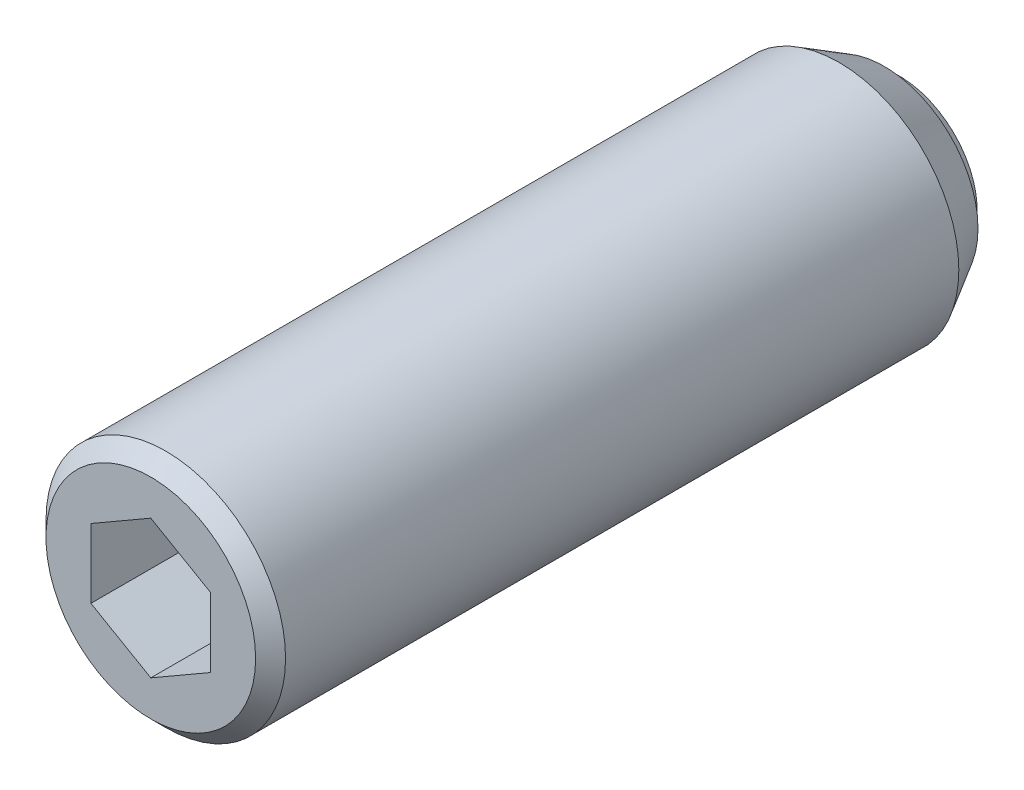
ISO-10303-21;
HEADER;
FILE_DESCRIPTION(('STEP AP214'),'2;1');
FILE_NAME('part.step','',(''),(''),'','','');
FILE_SCHEMA(('AUTOMOTIVE_DESIGN { 1 0 10303 214 1 1 1 1 }'));
ENDSEC;
DATA;
#1=APPLICATION_CONTEXT('core data for automotive mechanical design processes');
#2=APPLICATION_PROTOCOL_DEFINITION('international standard','automotive_design',2000,#1);
#3=PRODUCT_CONTEXT('',#1,'mechanical');
#4=PRODUCT('Part','Part','',(#3));
#5=PRODUCT_RELATED_PRODUCT_CATEGORY('part','',(#4));
#6=PRODUCT_DEFINITION_FORMATION('','',#4);
#7=PRODUCT_DEFINITION_CONTEXT('part definition',#1,'design');
#8=PRODUCT_DEFINITION('design','',#6,#7);
#9=PRODUCT_DEFINITION_SHAPE('','',#8);
#10=(LENGTH_UNIT() NAMED_UNIT(*) SI_UNIT(.MILLI.,.METRE.));
#11=(NAMED_UNIT(*) PLANE_ANGLE_UNIT() SI_UNIT($,.RADIAN.));
#12=(NAMED_UNIT(*) SI_UNIT($,.STERADIAN.) SOLID_ANGLE_UNIT());
#13=UNCERTAINTY_MEASURE_WITH_UNIT(LENGTH_MEASURE(1.E-05),#10,'distance_accuracy_value','');
#14=(GEOMETRIC_REPRESENTATION_CONTEXT(3) GLOBAL_UNCERTAINTY_ASSIGNED_CONTEXT((#13)) GLOBAL_UNIT_ASSIGNED_CONTEXT((#10,
#11,#12)) REPRESENTATION_CONTEXT('',''));
#15=CARTESIAN_POINT('',(0.,0.,0.));
#16=DIRECTION('',(0.,0.,1.));
#17=DIRECTION('',(1.,0.,0.));
#18=AXIS2_PLACEMENT_3D('',#15,#16,#17);
#19=CARTESIAN_POINT('',(4.,2.30940107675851,47.5));
#20=DIRECTION('',(0.5,0.86602540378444,0.));
#21=DIRECTION('',(0.86602540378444,-0.5,0.));
#22=AXIS2_PLACEMENT_3D('',#19,#20,#21);
#23=PLANE('',#22);
#24=DIRECTION('',(0.,0.,1.));
#25=VECTOR('',#24,1.);
#26=CARTESIAN_POINT('',(4.,2.30940107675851,47.5));
#27=LINE('',#26,#25);
#28=CARTESIAN_POINT('',(4.,2.30940107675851,44.));
#29=VERTEX_POINT('',#28);
#30=CARTESIAN_POINT('',(4.,2.30940107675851,50.));
#31=VERTEX_POINT('',#30);
#32=EDGE_CURVE('E68',#29,#31,#27,.T.);
#33=ORIENTED_EDGE('',*,*,#32,.T.);
#34=DIRECTION('',(-0.86602540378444,0.5,0.));
#35=VECTOR('',#34,1.);
#36=CARTESIAN_POINT('',(4.,2.30940107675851,50.));
#37=LINE('',#36,#35);
#38=CARTESIAN_POINT('',(0.,4.618802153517,50.));
#39=VERTEX_POINT('',#38);
#40=EDGE_CURVE('E29',#31,#39,#37,.T.);
#41=ORIENTED_EDGE('',*,*,#40,.T.);
#42=DIRECTION('',(0.,0.,1.));
#43=VECTOR('',#42,1.);
#44=CARTESIAN_POINT('',(0.,4.618802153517,47.5));
#45=LINE('',#44,#43);
#46=CARTESIAN_POINT('',(0.,4.618802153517,44.));
#47=VERTEX_POINT('',#46);
#48=EDGE_CURVE('E80',#47,#39,#45,.T.);
#49=ORIENTED_EDGE('',*,*,#48,.F.);
#50=DIRECTION('',(-0.86602540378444,0.5,0.));
#51=VECTOR('',#50,1.);
#52=CARTESIAN_POINT('',(4.,2.30940107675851,44.));
#53=LINE('',#52,#51);
#54=EDGE_CURVE('E79',#29,#47,#53,.T.);
#55=ORIENTED_EDGE('',*,*,#54,.F.);
#56=EDGE_LOOP('',(#33,#41,#49,#55));
#57=FACE_BOUND('',#56,.T.);
#58=ADVANCED_FACE('F14',(#57),#23,.F.);
#59=CARTESIAN_POINT('',(4.,-2.30940107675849,47.5));
#60=DIRECTION('',(1.,0.,0.));
#61=DIRECTION('',(0.,-1.,0.));
#62=AXIS2_PLACEMENT_3D('',#59,#60,#61);
#63=PLANE('',#62);
#64=DIRECTION('',(0.,0.,1.));
#65=VECTOR('',#64,1.);
#66=CARTESIAN_POINT('',(4.,-2.30940107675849,47.5));
#67=LINE('',#66,#65);
#68=CARTESIAN_POINT('',(4.,-2.30940107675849,44.));
#69=VERTEX_POINT('',#68);
#70=CARTESIAN_POINT('',(4.,-2.30940107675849,50.));
#71=VERTEX_POINT('',#70);
#72=EDGE_CURVE('E76',#69,#71,#67,.T.);
#73=ORIENTED_EDGE('',*,*,#72,.T.);
#74=DIRECTION('',(0.,1.,0.));
#75=VECTOR('',#74,1.);
#76=CARTESIAN_POINT('',(4.,-2.30940107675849,50.));
#77=LINE('',#76,#75);
#78=EDGE_CURVE('E75',#71,#31,#77,.T.);
#79=ORIENTED_EDGE('',*,*,#78,.T.);
#80=ORIENTED_EDGE('',*,*,#32,.F.);
#81=DIRECTION('',(0.,1.,0.));
#82=VECTOR('',#81,1.);
#83=CARTESIAN_POINT('',(4.,-2.30940107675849,44.));
#84=LINE('',#83,#82);
#85=EDGE_CURVE('E72',#69,#29,#84,.T.);
#86=ORIENTED_EDGE('',*,*,#85,.F.);
#87=EDGE_LOOP('',(#73,#79,#80,#86));
#88=FACE_BOUND('',#87,.T.);
#89=ADVANCED_FACE('F70',(#88),#63,.F.);
#90=CARTESIAN_POINT('',(4.,-2.30940107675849,47.5));
#91=DIRECTION('',(-0.5,0.866025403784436,0.));
#92=DIRECTION('',(0.866025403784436,0.5,0.));
#93=AXIS2_PLACEMENT_3D('',#90,#91,#92);
#94=PLANE('',#93);
#95=DIRECTION('',(0.,0.,1.));
#96=VECTOR('',#95,1.);
#97=CARTESIAN_POINT('',(0.,-4.61880215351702,47.5));
#98=LINE('',#97,#96);
#99=CARTESIAN_POINT('',(0.,-4.61880215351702,44.));
#100=VERTEX_POINT('',#99);
#101=CARTESIAN_POINT('',(0.,-4.61880215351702,50.));
#102=VERTEX_POINT('',#101);
#103=EDGE_CURVE('E122',#100,#102,#98,.T.);
#104=ORIENTED_EDGE('',*,*,#103,.T.);
#105=DIRECTION('',(-0.866025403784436,-0.5,0.));
#106=VECTOR('',#105,1.);
#107=CARTESIAN_POINT('',(4.,-2.30940107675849,50.));
#108=LINE('',#107,#106);
#109=EDGE_CURVE('E113',#71,#102,#108,.T.);
#110=ORIENTED_EDGE('',*,*,#109,.F.);
#111=ORIENTED_EDGE('',*,*,#72,.F.);
#112=DIRECTION('',(0.866025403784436,0.5,0.));
#113=VECTOR('',#112,1.);
#114=CARTESIAN_POINT('',(0.,-4.61880215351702,44.));
#115=LINE('',#114,#113);
#116=EDGE_CURVE('E89',#100,#69,#115,.T.);
#117=ORIENTED_EDGE('',*,*,#116,.F.);
#118=EDGE_LOOP('',(#104,#110,#111,#117));
#119=FACE_BOUND('',#118,.T.);
#120=ADVANCED_FACE('F147',(#119),#94,.T.);
#121=CARTESIAN_POINT('',(-4.,-2.30940107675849,47.5));
#122=DIRECTION('',(-0.5,-0.866025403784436,0.));
#123=DIRECTION('',(-0.866025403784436,0.5,0.));
#124=AXIS2_PLACEMENT_3D('',#121,#122,#123);
#125=PLANE('',#124);
#126=DIRECTION('',(0.,0.,1.));
#127=VECTOR('',#126,1.);
#128=CARTESIAN_POINT('',(-4.,-2.30940107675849,47.5));
#129=LINE('',#128,#127);
#130=CARTESIAN_POINT('',(-4.,-2.30940107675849,44.));
#131=VERTEX_POINT('',#130);
#132=CARTESIAN_POINT('',(-4.,-2.30940107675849,50.));
#133=VERTEX_POINT('',#132);
#134=EDGE_CURVE('E120',#131,#133,#129,.T.);
#135=ORIENTED_EDGE('',*,*,#134,.T.);
#136=DIRECTION('',(0.866025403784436,-0.5,0.));
#137=VECTOR('',#136,1.);
#138=CARTESIAN_POINT('',(-4.,-2.30940107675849,50.));
#139=LINE('',#138,#137);
#140=EDGE_CURVE('E111',#133,#102,#139,.T.);
#141=ORIENTED_EDGE('',*,*,#140,.T.);
#142=ORIENTED_EDGE('',*,*,#103,.F.);
#143=DIRECTION('',(0.866025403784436,-0.5,0.));
#144=VECTOR('',#143,1.);
#145=CARTESIAN_POINT('',(-4.,-2.30940107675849,44.));
#146=LINE('',#145,#144);
#147=EDGE_CURVE('E101',#131,#100,#146,.T.);
#148=ORIENTED_EDGE('',*,*,#147,.F.);
#149=EDGE_LOOP('',(#135,#141,#142,#148));
#150=FACE_BOUND('',#149,.T.);
#151=ADVANCED_FACE('F157',(#150),#125,.F.);
#152=CARTESIAN_POINT('',(-4.,-2.30940107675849,47.5));
#153=DIRECTION('',(1.,0.,0.));
#154=DIRECTION('',(0.,-1.,0.));
#155=AXIS2_PLACEMENT_3D('',#152,#153,#154);
#156=PLANE('',#155);
#157=DIRECTION('',(0.,0.,1.));
#158=VECTOR('',#157,1.);
#159=CARTESIAN_POINT('',(-4.,2.30940107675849,47.5));
#160=LINE('',#159,#158);
#161=CARTESIAN_POINT('',(-4.,2.30940107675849,44.));
#162=VERTEX_POINT('',#161);
#163=CARTESIAN_POINT('',(-4.,2.30940107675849,50.));
#164=VERTEX_POINT('',#163);
#165=EDGE_CURVE('E37',#162,#164,#160,.T.);
#166=ORIENTED_EDGE('',*,*,#165,.T.);
#167=DIRECTION('',(0.,1.,0.));
#168=VECTOR('',#167,1.);
#169=CARTESIAN_POINT('',(-4.,-2.30940107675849,50.));
#170=LINE('',#169,#168);
#171=EDGE_CURVE('E108',#133,#164,#170,.T.);
#172=ORIENTED_EDGE('',*,*,#171,.F.);
#173=ORIENTED_EDGE('',*,*,#134,.F.);
#174=DIRECTION('',(0.,-1.,0.));
#175=VECTOR('',#174,1.);
#176=CARTESIAN_POINT('',(-4.,2.30940107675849,44.));
#177=LINE('',#176,#175);
#178=EDGE_CURVE('E98',#162,#131,#177,.T.);
#179=ORIENTED_EDGE('',*,*,#178,.F.);
#180=EDGE_LOOP('',(#166,#172,#173,#179));
#181=FACE_BOUND('',#180,.T.);
#182=ADVANCED_FACE('F153',(#181),#156,.T.);
#183=CARTESIAN_POINT('',(-4.,2.30940107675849,47.5));
#184=DIRECTION('',(0.5,-0.866025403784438,0.));
#185=DIRECTION('',(-0.866025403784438,-0.5,0.));
#186=AXIS2_PLACEMENT_3D('',#183,#184,#185);
#187=PLANE('',#186);
#188=ORIENTED_EDGE('',*,*,#165,.F.);
#189=DIRECTION('',(-0.866025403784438,-0.5,0.));
#190=VECTOR('',#189,1.);
#191=CARTESIAN_POINT('',(0.,4.618802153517,44.));
#192=LINE('',#191,#190);
#193=EDGE_CURVE('E84',#47,#162,#192,.T.);
#194=ORIENTED_EDGE('',*,*,#193,.F.);
#195=ORIENTED_EDGE('',*,*,#48,.T.);
#196=DIRECTION('',(0.866025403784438,0.5,0.));
#197=VECTOR('',#196,1.);
#198=CARTESIAN_POINT('',(-4.,2.30940107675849,50.));
#199=LINE('',#198,#197);
#200=EDGE_CURVE('E105',#164,#39,#199,.T.);
#201=ORIENTED_EDGE('',*,*,#200,.F.);
#202=EDGE_LOOP('',(#188,#194,#195,#201));
#203=FACE_BOUND('',#202,.T.);
#204=ADVANCED_FACE('F150',(#203),#187,.T.);
#205=CARTESIAN_POINT('',(0.,0.,49.75));
#206=DIRECTION('',(0.,0.,-1.));
#207=DIRECTION('',(1.,0.,0.));
#208=AXIS2_PLACEMENT_3D('',#205,#206,#207);
#209=CYLINDRICAL_SURFACE('',#208,8.);
#210=CARTESIAN_POINT('',(0.,0.,49.));
#211=DIRECTION('',(0.,0.,-1.));
#212=DIRECTION('',(1.,0.,0.));
#213=AXIS2_PLACEMENT_3D('',#210,#211,#212);
#214=CIRCLE('',#213,8.);
#215=CARTESIAN_POINT('',(8.,0.,49.));
#216=VERTEX_POINT('',#215);
#217=EDGE_CURVE('E9',#216,#216,#214,.T.);
#218=ORIENTED_EDGE('',*,*,#217,.T.);
#219=EDGE_LOOP('',(#218));
#220=FACE_BOUND('',#219,.T.);
#221=CARTESIAN_POINT('',(0.,0.,4.03108891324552));
#222=DIRECTION('',(0.,0.,-1.));
#223=DIRECTION('',(-1.,0.,0.));
#224=AXIS2_PLACEMENT_3D('',#221,#222,#223);
#225=CIRCLE('',#224,8.);
#226=CARTESIAN_POINT('',(-8.,0.,4.03108891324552));
#227=VERTEX_POINT('',#226);
#228=EDGE_CURVE('E260',#227,#227,#225,.T.);
#229=ORIENTED_EDGE('',*,*,#228,.F.);
#230=EDGE_LOOP('',(#229));
#231=FACE_BOUND('',#230,.T.);
#232=ADVANCED_FACE('F16',(#220,#231),#209,.T.);
#233=CARTESIAN_POINT('',(0.,0.,49.));
#234=DIRECTION('',(0.,0.,-1.));
#235=DIRECTION('',(1.,0.,0.));
#236=AXIS2_PLACEMENT_3D('',#233,#234,#235);
#237=CONICAL_SURFACE('',#236,8.,0.785398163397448);
#238=CARTESIAN_POINT('',(0.,0.,50.));
#239=DIRECTION('',(0.,0.,-1.));
#240=DIRECTION('',(1.,0.,0.));
#241=AXIS2_PLACEMENT_3D('',#238,#239,#240);
#242=CIRCLE('',#241,7.);
#243=CARTESIAN_POINT('',(7.,0.,50.));
#244=VERTEX_POINT('',#243);
#245=EDGE_CURVE('E22',#244,#244,#242,.T.);
#246=ORIENTED_EDGE('',*,*,#245,.T.);
#247=EDGE_LOOP('',(#246));
#248=FACE_BOUND('',#247,.T.);
#249=ORIENTED_EDGE('',*,*,#217,.F.);
#250=EDGE_LOOP('',(#249));
#251=FACE_BOUND('',#250,.T.);
#252=ADVANCED_FACE('F127',(#248,#251),#237,.T.);
#253=CARTESIAN_POINT('',(0.,0.,50.));
#254=DIRECTION('',(0.,0.,-1.));
#255=DIRECTION('',(1.,0.,0.));
#256=AXIS2_PLACEMENT_3D('',#253,#254,#255);
#257=PLANE('',#256);
#258=ORIENTED_EDGE('',*,*,#200,.T.);
#259=ORIENTED_EDGE('',*,*,#40,.F.);
#260=ORIENTED_EDGE('',*,*,#78,.F.);
#261=ORIENTED_EDGE('',*,*,#109,.T.);
#262=ORIENTED_EDGE('',*,*,#140,.F.);
#263=ORIENTED_EDGE('',*,*,#171,.T.);
#264=EDGE_LOOP('',(#258,#259,#260,#261,#262,#263));
#265=FACE_BOUND('',#264,.T.);
#266=ORIENTED_EDGE('',*,*,#245,.F.);
#267=EDGE_LOOP('',(#266));
#268=FACE_BOUND('',#267,.T.);
#269=ADVANCED_FACE('F130',(#265,#268),#257,.F.);
#270=CARTESIAN_POINT('',(4.,2.30940107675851,44.));
#271=DIRECTION('',(0.,0.,1.));
#272=DIRECTION('',(1.,0.,0.));
#273=AXIS2_PLACEMENT_3D('',#270,#271,#272);
#274=PLANE('',#273);
#275=ORIENTED_EDGE('',*,*,#85,.T.);
#276=ORIENTED_EDGE('',*,*,#54,.T.);
#277=ORIENTED_EDGE('',*,*,#193,.T.);
#278=ORIENTED_EDGE('',*,*,#178,.T.);
#279=ORIENTED_EDGE('',*,*,#147,.T.);
#280=ORIENTED_EDGE('',*,*,#116,.T.);
#281=EDGE_LOOP('',(#275,#276,#277,#278,#279,#280));
#282=FACE_BOUND('',#281,.T.);
#283=ADVANCED_FACE('F86',(#282),#274,.T.);
#284=CARTESIAN_POINT('',(0.,0.,0.));
#285=DIRECTION('',(0.,0.,-1.));
#286=DIRECTION('',(-1.,0.,0.));
#287=AXIS2_PLACEMENT_3D('',#284,#285,#286);
#288=PLANE('',#287);
#289=CARTESIAN_POINT('',(0.,0.,0.));
#290=DIRECTION('',(0.,0.,-1.));
#291=DIRECTION('',(-1.,0.,0.));
#292=AXIS2_PLACEMENT_3D('',#289,#290,#291);
#293=CIRCLE('',#292,5.19615242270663);
#294=CARTESIAN_POINT('',(-5.19615242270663,0.,0.));
#295=VERTEX_POINT('',#294);
#296=EDGE_CURVE('E90',#295,#295,#293,.T.);
#297=ORIENTED_EDGE('',*,*,#296,.T.);
#298=EDGE_LOOP('',(#297));
#299=FACE_BOUND('',#298,.T.);
#300=ADVANCED_FACE('F139',(#299),#288,.T.);
#301=CARTESIAN_POINT('',(0.,0.,3.));
#302=DIRECTION('',(0.,0.,-1.));
#303=DIRECTION('',(-1.,0.,0.));
#304=AXIS2_PLACEMENT_3D('',#301,#302,#303);
#305=SPHERICAL_SURFACE('',#304,6.);
#306=CARTESIAN_POINT('',(0.,0.,1.));
#307=DIRECTION('',(0.,0.,-1.));
#308=DIRECTION('',(-1.,0.,0.));
#309=AXIS2_PLACEMENT_3D('',#306,#307,#308);
#310=CIRCLE('',#309,5.65685424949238);
#311=CARTESIAN_POINT('',(-5.65685424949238,0.,1.));
#312=VERTEX_POINT('',#311);
#313=EDGE_CURVE('E93',#312,#312,#310,.T.);
#314=CARTESIAN_POINT('',(-5.65685424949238,0.,1.));
#315=CARTESIAN_POINT('',(-5.65302587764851,0.,0.989171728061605));
#316=CARTESIAN_POINT('',(-5.64916641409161,0.,0.978354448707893));
#317=CARTESIAN_POINT('',(-5.64138543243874,0.,0.956742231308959));
#318=CARTESIAN_POINT('',(-5.63746391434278,0.,0.945947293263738));
#319=CARTESIAN_POINT('',(-5.62955895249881,0.,0.924380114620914));
#320=CARTESIAN_POINT('',(-5.62557550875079,0.,0.913607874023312));
#321=CARTESIAN_POINT('',(-5.61754682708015,0.,0.892086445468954));
#322=CARTESIAN_POINT('',(-5.61350158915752,0.,0.881337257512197));
#323=CARTESIAN_POINT('',(-5.60534945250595,0.,0.859862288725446));
#324=CARTESIAN_POINT('',(-5.60124255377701,0.,0.849136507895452));
#325=CARTESIAN_POINT('',(-5.59296723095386,0.,0.827708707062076));
#326=CARTESIAN_POINT('',(-5.58879880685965,0.,0.817006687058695));
#327=CARTESIAN_POINT('',(-5.58040057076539,0.,0.795626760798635));
#328=CARTESIAN_POINT('',(-5.57617075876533,0.,0.784948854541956));
#329=CARTESIAN_POINT('',(-5.56764988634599,0.,0.763617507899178));
#330=CARTESIAN_POINT('',(-5.56335882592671,0.,0.752964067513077));
#331=CARTESIAN_POINT('',(-5.55471559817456,0.,0.731682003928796));
#332=CARTESIAN_POINT('',(-5.55036343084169,0.,0.721053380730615));
#333=CARTESIAN_POINT('',(-5.54159813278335,0.,0.699821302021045));
#334=CARTESIAN_POINT('',(-5.53718500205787,0.,0.689217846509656));
#335=CARTESIAN_POINT('',(-5.52829792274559,0.,0.668036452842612));
#336=CARTESIAN_POINT('',(-5.52382397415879,0.,0.657458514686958));
#337=CARTESIAN_POINT('',(-5.51481540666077,0.,0.636328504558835));
#338=CARTESIAN_POINT('',(-5.51028078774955,0.,0.625776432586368));
#339=CARTESIAN_POINT('',(-5.50115102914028,0.,0.604698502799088));
#340=CARTESIAN_POINT('',(-5.49655588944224,0.,0.594172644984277));
#341=CARTESIAN_POINT('',(-5.48730524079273,0.,0.573147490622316));
#342=CARTESIAN_POINT('',(-5.48264973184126,0.,0.562648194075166));
#343=CARTESIAN_POINT('',(-5.47327849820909,0.,0.541676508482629));
#344=CARTESIAN_POINT('',(-5.46856277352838,0.,0.531204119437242));
#345=CARTESIAN_POINT('',(-5.45907126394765,0.,0.510286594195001));
#346=CARTESIAN_POINT('',(-5.45429547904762,0.,0.499841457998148));
#347=CARTESIAN_POINT('',(-5.44468400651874,0.,0.478978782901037));
#348=CARTESIAN_POINT('',(-5.43984831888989,0.,0.468561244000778));
#349=CARTESIAN_POINT('',(-5.4301172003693,0.,0.447754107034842));
#350=CARTESIAN_POINT('',(-5.42522176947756,0.,0.437364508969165));
#351=CARTESIAN_POINT('',(-5.41537132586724,0.,0.416613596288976));
#352=CARTESIAN_POINT('',(-5.41041631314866,0.,0.406252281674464));
#353=CARTESIAN_POINT('',(-5.40044686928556,0.,0.38555827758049));
#354=CARTESIAN_POINT('',(-5.39543243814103,0.,0.375225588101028));
#355=CARTESIAN_POINT('',(-5.38534432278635,0.,0.354589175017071));
#356=CARTESIAN_POINT('',(-5.3802706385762,0.,0.344285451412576));
#357=CARTESIAN_POINT('',(-5.37006418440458,0.,0.323707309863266));
#358=CARTESIAN_POINT('',(-5.3649314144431,0.,0.313432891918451));
#359=CARTESIAN_POINT('',(-5.35460695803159,0.,0.292913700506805));
#360=CARTESIAN_POINT('',(-5.34941527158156,0.,0.282668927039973));
#361=CARTESIAN_POINT('',(-5.33897315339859,0.,0.262209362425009));
#362=CARTESIAN_POINT('',(-5.33372272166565,0.,0.251994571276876));
#363=CARTESIAN_POINT('',(-5.32316328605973,0.,0.231595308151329));
#364=CARTESIAN_POINT('',(-5.31785428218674,0.,0.221410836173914));
#365=CARTESIAN_POINT('',(-5.30717787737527,0.,0.201072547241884));
#366=CARTESIAN_POINT('',(-5.30181047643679,0.,0.190918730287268));
#367=CARTESIAN_POINT('',(-5.29101745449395,0.,0.170642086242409));
#368=CARTESIAN_POINT('',(-5.28559183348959,0.,0.160519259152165));
#369=CARTESIAN_POINT('',(-5.27468255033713,0.,0.140304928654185));
#370=CARTESIAN_POINT('',(-5.26919888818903,0.,0.130213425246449));
#371=CARTESIAN_POINT('',(-5.25817370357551,0.,0.110062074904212));
#372=CARTESIAN_POINT('',(-5.25263218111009,0.,0.100002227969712));
#373=CARTESIAN_POINT('',(-5.24149145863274,0.,0.0799145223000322));
#374=CARTESIAN_POINT('',(-5.23589225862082,0.,0.0698866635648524));
#375=CARTESIAN_POINT('',(-5.22463636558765,0.,0.0498632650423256));
#376=CARTESIAN_POINT('',(-5.2189796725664,0.,0.0398677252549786));
#377=CARTESIAN_POINT('',(-5.20760898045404,0.,0.0199092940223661));
#378=CARTESIAN_POINT('',(-5.20189498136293,0.,0.00994640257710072));
#379=CARTESIAN_POINT('',(-5.19615242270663,0.,0.));
#380=B_SPLINE_CURVE_WITH_KNOTS('',3,(#314,#315,#316,#317,#318,#319,#320,#321,#322,#323,#324,
#325,#326,#327,#328,#329,#330,#331,#332,#333,#334,#335,#336,#337,#338,#339,#340,#341,#342,#343,
#344,#345,#346,#347,#348,#349,#350,#351,#352,#353,#354,#355,#356,#357,#358,#359,#360,#361,#362,
#363,#364,#365,#366,#367,#368,#369,#370,#371,#372,#373,#374,#375,#376,#377,#378,#379),
.UNSPECIFIED.,.F.,.F.,(4,2,2,2,2,2,2,2,2,2,2,2,2,2,2,2,2,2,2,2,2,2,2,2,2,2,2,2,2,2,2,2,4),(0.,
0.0344553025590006,0.0689106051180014,0.103365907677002,0.137821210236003,0.172276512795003,
0.206731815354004,0.241187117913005,0.275642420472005,0.310097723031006,0.344553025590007,
0.379008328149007,0.413463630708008,0.447918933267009,0.48237423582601,0.51682953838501,
0.551284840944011,0.585740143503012,0.620195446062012,0.654650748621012,0.689106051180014,
0.723561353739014,0.758016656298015,0.792471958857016,0.826927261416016,0.861382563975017,
0.895837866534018,0.930293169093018,0.964748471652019,0.99920377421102,1.03365907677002,
1.06811437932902,1.10256968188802),.UNSPECIFIED.);
#381=EDGE_CURVE('BSEAM223',#312,#295,#380,.T.);
#382=ORIENTED_EDGE('',*,*,#313,.T.);
#383=ORIENTED_EDGE('',*,*,#296,.F.);
#384=ORIENTED_EDGE('',*,*,#381,.T.);
#385=ORIENTED_EDGE('',*,*,#381,.F.);
#386=EDGE_LOOP('',(#382,#384,#383,#385));
#387=FACE_BOUND('',#386,.T.);
#388=ADVANCED_FACE('F223',(#387),#305,.T.);
#389=CARTESIAN_POINT('',(-5.65685424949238,0.,1.));
#390=DIRECTION('',(0.,0.,-1.));
#391=DIRECTION('',(-1.,0.,0.));
#392=AXIS2_PLACEMENT_3D('',#389,#390,#391);
#393=PLANE('',#392);
#394=CARTESIAN_POINT('',(0.,0.,1.));
#395=DIRECTION('',(0.,0.,-1.));
#396=DIRECTION('',(-1.,0.,0.));
#397=AXIS2_PLACEMENT_3D('',#394,#395,#396);
#398=CIRCLE('',#397,6.25);
#399=CARTESIAN_POINT('',(-6.25,0.,1.));
#400=VERTEX_POINT('',#399);
#401=EDGE_CURVE('E263',#400,#400,#398,.T.);
#402=ORIENTED_EDGE('',*,*,#401,.T.);
#403=EDGE_LOOP('',(#402));
#404=FACE_BOUND('',#403,.T.);
#405=ORIENTED_EDGE('',*,*,#313,.F.);
#406=EDGE_LOOP('',(#405));
#407=FACE_BOUND('',#406,.T.);
#408=ADVANCED_FACE('F232',(#404,#407),#393,.T.);
#409=CARTESIAN_POINT('',(0.,0.,1.));
#410=DIRECTION('',(0.,0.,1.));
#411=DIRECTION('',(1.,0.,0.));
#412=AXIS2_PLACEMENT_3D('',#409,#410,#411);
#413=CONICAL_SURFACE('',#412,6.25,0.523598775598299);
#414=ORIENTED_EDGE('',*,*,#228,.T.);
#415=EDGE_LOOP('',(#414));
#416=FACE_BOUND('',#415,.T.);
#417=ORIENTED_EDGE('',*,*,#401,.F.);
#418=EDGE_LOOP('',(#417));
#419=FACE_BOUND('',#418,.T.);
#420=ADVANCED_FACE('F242',(#416,#419),#413,.T.);
#421=CLOSED_SHELL('',(#58,#89,#120,#151,#182,#204,#232,#252,#269,#283,#300,#388,#408,#420));
#422=MANIFOLD_SOLID_BREP('B1',#421);
#423=ADVANCED_BREP_SHAPE_REPRESENTATION('',(#18,#422),#14);
#424=SHAPE_DEFINITION_REPRESENTATION(#9,#423);
ENDSEC;
END-ISO-10303-21;
